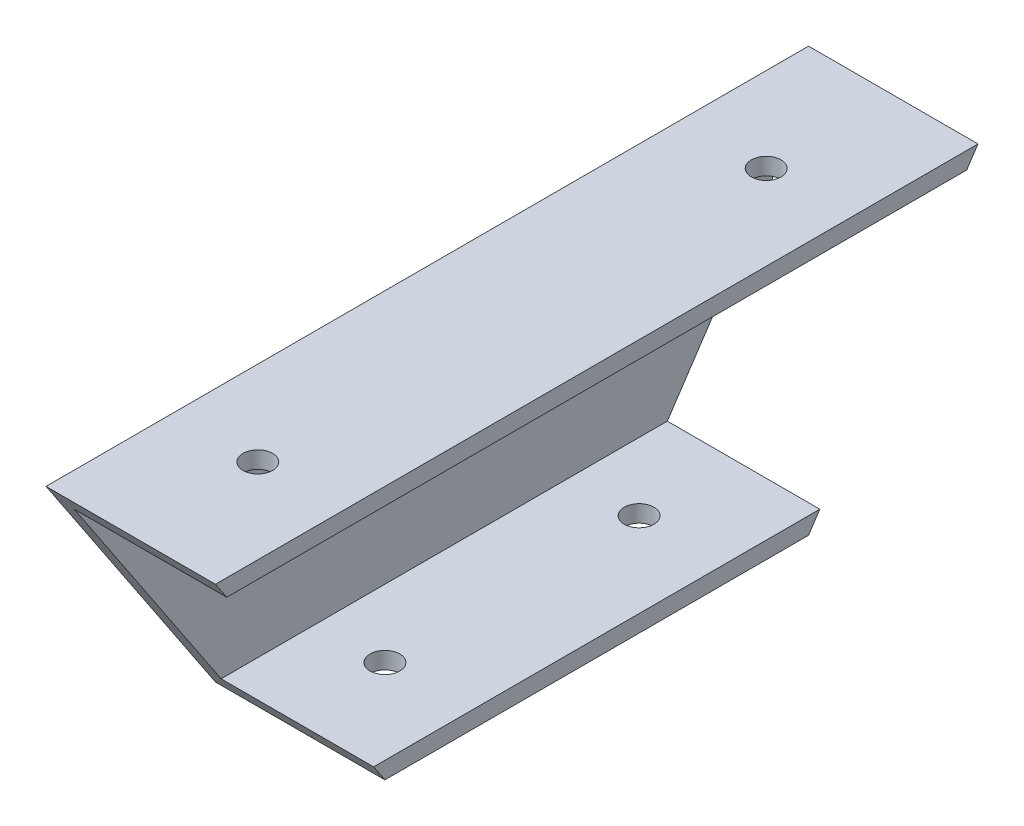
ISO-10303-21;
HEADER;
FILE_DESCRIPTION(('STEP AP214'),'2;1');
FILE_NAME('part.step','',(''),(''),'','','');
FILE_SCHEMA(('AUTOMOTIVE_DESIGN { 1 0 10303 214 1 1 1 1 }'));
ENDSEC;
DATA;
#1=APPLICATION_CONTEXT('core data for automotive mechanical design processes');
#2=APPLICATION_PROTOCOL_DEFINITION('international standard','automotive_design',2000,#1);
#3=PRODUCT_CONTEXT('',#1,'mechanical');
#4=PRODUCT('Part','Part','',(#3));
#5=PRODUCT_RELATED_PRODUCT_CATEGORY('part','',(#4));
#6=PRODUCT_DEFINITION_FORMATION('','',#4);
#7=PRODUCT_DEFINITION_CONTEXT('part definition',#1,'design');
#8=PRODUCT_DEFINITION('design','',#6,#7);
#9=PRODUCT_DEFINITION_SHAPE('','',#8);
#10=(LENGTH_UNIT() NAMED_UNIT(*) SI_UNIT(.MILLI.,.METRE.));
#11=(NAMED_UNIT(*) PLANE_ANGLE_UNIT() SI_UNIT($,.RADIAN.));
#12=(NAMED_UNIT(*) SI_UNIT($,.STERADIAN.) SOLID_ANGLE_UNIT());
#13=UNCERTAINTY_MEASURE_WITH_UNIT(LENGTH_MEASURE(1.E-05),#10,'distance_accuracy_value','');
#14=(GEOMETRIC_REPRESENTATION_CONTEXT(3) GLOBAL_UNCERTAINTY_ASSIGNED_CONTEXT((#13)) GLOBAL_UNIT_ASSIGNED_CONTEXT((#10,
#11,#12)) REPRESENTATION_CONTEXT('',''));
#15=CARTESIAN_POINT('',(0.,0.,0.));
#16=DIRECTION('',(0.,0.,1.));
#17=DIRECTION('',(1.,0.,0.));
#18=AXIS2_PLACEMENT_3D('',#15,#16,#17);
#19=CARTESIAN_POINT('',(0.,30.,90.));
#20=DIRECTION('',(1.,0.,0.));
#21=DIRECTION('',(0.,1.,0.));
#22=AXIS2_PLACEMENT_3D('',#19,#20,#21);
#23=PLANE('',#22);
#24=DIRECTION('',(0.,0.,-1.));
#25=VECTOR('',#24,1.);
#26=CARTESIAN_POINT('',(0.,0.,90.));
#27=LINE('',#26,#25);
#28=CARTESIAN_POINT('',(0.,0.,70.));
#29=VERTEX_POINT('',#28);
#30=CARTESIAN_POINT('',(0.,0.,20.));
#31=VERTEX_POINT('',#30);
#32=EDGE_CURVE('E11',#29,#31,#27,.T.);
#33=ORIENTED_EDGE('',*,*,#32,.F.);
#34=DIRECTION('',(0.,0.832050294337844,0.554700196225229));
#35=VECTOR('',#34,1.);
#36=CARTESIAN_POINT('',(0.,30.,90.));
#37=LINE('',#36,#35);
#38=CARTESIAN_POINT('',(0.,30.,90.));
#39=VERTEX_POINT('',#38);
#40=EDGE_CURVE('E90',#29,#39,#37,.T.);
#41=ORIENTED_EDGE('',*,*,#40,.T.);
#42=DIRECTION('',(0.,0.,-1.));
#43=VECTOR('',#42,1.);
#44=CARTESIAN_POINT('',(0.,30.,90.));
#45=LINE('',#44,#43);
#46=CARTESIAN_POINT('',(0.,30.,0.));
#47=VERTEX_POINT('',#46);
#48=EDGE_CURVE('E113',#39,#47,#45,.T.);
#49=ORIENTED_EDGE('',*,*,#48,.T.);
#50=DIRECTION('',(0.,-0.832050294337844,0.554700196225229));
#51=VECTOR('',#50,1.);
#52=CARTESIAN_POINT('',(0.,-11.5384615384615,27.6923076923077));
#53=LINE('',#52,#51);
#54=EDGE_CURVE('E112',#47,#31,#53,.T.);
#55=ORIENTED_EDGE('',*,*,#54,.T.);
#56=EDGE_LOOP('',(#33,#41,#49,#55));
#57=FACE_BOUND('',#56,.T.);
#58=ADVANCED_FACE('F31',(#57),#23,.F.);
#59=CARTESIAN_POINT('',(0.,0.,90.));
#60=DIRECTION('',(0.,1.,0.));
#61=DIRECTION('',(0.,0.,1.));
#62=AXIS2_PLACEMENT_3D('',#59,#60,#61);
#63=PLANE('',#62);
#64=CARTESIAN_POINT('',(9.99999999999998,0.,60.));
#65=DIRECTION('',(0.,-1.,0.));
#66=DIRECTION('',(0.,0.,-1.));
#67=AXIS2_PLACEMENT_3D('',#64,#65,#66);
#68=CIRCLE('',#67,1.75);
#69=CARTESIAN_POINT('',(9.99999999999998,0.,58.25));
#70=VERTEX_POINT('',#69);
#71=EDGE_CURVE('E144',#70,#70,#68,.T.);
#72=ORIENTED_EDGE('',*,*,#71,.F.);
#73=EDGE_LOOP('',(#72));
#74=FACE_BOUND('',#73,.T.);
#75=CARTESIAN_POINT('',(9.99999999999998,0.,30.));
#76=DIRECTION('',(0.,-1.,0.));
#77=DIRECTION('',(0.,0.,-1.));
#78=AXIS2_PLACEMENT_3D('',#75,#76,#77);
#79=CIRCLE('',#78,1.75);
#80=CARTESIAN_POINT('',(9.99999999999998,0.,28.25));
#81=VERTEX_POINT('',#80);
#82=EDGE_CURVE('E141',#81,#81,#79,.T.);
#83=ORIENTED_EDGE('',*,*,#82,.F.);
#84=EDGE_LOOP('',(#83));
#85=FACE_BOUND('',#84,.T.);
#86=DIRECTION('',(0.,0.,-1.));
#87=VECTOR('',#86,1.);
#88=CARTESIAN_POINT('',(20.,0.,90.));
#89=LINE('',#88,#87);
#90=CARTESIAN_POINT('',(20.,0.,70.));
#91=VERTEX_POINT('',#90);
#92=CARTESIAN_POINT('',(20.,0.,20.));
#93=VERTEX_POINT('',#92);
#94=EDGE_CURVE('E40',#91,#93,#89,.T.);
#95=ORIENTED_EDGE('',*,*,#94,.F.);
#96=DIRECTION('',(1.,0.,0.));
#97=VECTOR('',#96,1.);
#98=CARTESIAN_POINT('',(-43.,0.,70.));
#99=LINE('',#98,#97);
#100=EDGE_CURVE('E93',#29,#91,#99,.T.);
#101=ORIENTED_EDGE('',*,*,#100,.F.);
#102=ORIENTED_EDGE('',*,*,#32,.T.);
#103=DIRECTION('',(1.,0.,0.));
#104=VECTOR('',#103,1.);
#105=CARTESIAN_POINT('',(-43.,0.,20.));
#106=LINE('',#105,#104);
#107=EDGE_CURVE('E101',#31,#93,#106,.T.);
#108=ORIENTED_EDGE('',*,*,#107,.T.);
#109=EDGE_LOOP('',(#95,#101,#102,#108));
#110=FACE_BOUND('',#109,.T.);
#111=ADVANCED_FACE('F106',(#74,#85,#110),#63,.F.);
#112=CARTESIAN_POINT('',(20.,0.,90.));
#113=DIRECTION('',(-1.,0.,0.));
#114=DIRECTION('',(0.,0.,1.));
#115=AXIS2_PLACEMENT_3D('',#112,#113,#114);
#116=PLANE('',#115);
#117=DIRECTION('',(0.,0.,-1.));
#118=VECTOR('',#117,1.);
#119=CARTESIAN_POINT('',(20.,2.,90.));
#120=LINE('',#119,#118);
#121=CARTESIAN_POINT('',(20.,2.,71.3333333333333));
#122=VERTEX_POINT('',#121);
#123=CARTESIAN_POINT('',(20.,2.,18.6666666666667));
#124=VERTEX_POINT('',#123);
#125=EDGE_CURVE('E136',#122,#124,#120,.T.);
#126=ORIENTED_EDGE('',*,*,#125,.F.);
#127=DIRECTION('',(0.,-0.832050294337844,-0.554700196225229));
#128=VECTOR('',#127,1.);
#129=CARTESIAN_POINT('',(20.,9.23076923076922,76.1538461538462));
#130=LINE('',#129,#128);
#131=EDGE_CURVE('E102',#122,#91,#130,.T.);
#132=ORIENTED_EDGE('',*,*,#131,.T.);
#133=ORIENTED_EDGE('',*,*,#94,.T.);
#134=DIRECTION('',(0.,0.832050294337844,-0.554700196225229));
#135=VECTOR('',#134,1.);
#136=CARTESIAN_POINT('',(20.,-32.3076923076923,41.5384615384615));
#137=LINE('',#136,#135);
#138=EDGE_CURVE('E117',#93,#124,#137,.T.);
#139=ORIENTED_EDGE('',*,*,#138,.T.);
#140=EDGE_LOOP('',(#126,#132,#133,#139));
#141=FACE_BOUND('',#140,.T.);
#142=ADVANCED_FACE('F193',(#141),#116,.F.);
#143=CARTESIAN_POINT('',(20.,2.,90.));
#144=DIRECTION('',(0.,-1.,0.));
#145=DIRECTION('',(1.,0.,0.));
#146=AXIS2_PLACEMENT_3D('',#143,#144,#145);
#147=PLANE('',#146);
#148=CARTESIAN_POINT('',(9.99999999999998,2.,60.));
#149=DIRECTION('',(0.,-1.,0.));
#150=DIRECTION('',(1.,0.,0.));
#151=AXIS2_PLACEMENT_3D('',#148,#149,#150);
#152=CIRCLE('',#151,1.75);
#153=CARTESIAN_POINT('',(11.75,2.,60.));
#154=VERTEX_POINT('',#153);
#155=EDGE_CURVE('E142',#154,#154,#152,.T.);
#156=ORIENTED_EDGE('',*,*,#155,.T.);
#157=EDGE_LOOP('',(#156));
#158=FACE_BOUND('',#157,.T.);
#159=CARTESIAN_POINT('',(9.99999999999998,2.,30.));
#160=DIRECTION('',(0.,-1.,0.));
#161=DIRECTION('',(1.,0.,0.));
#162=AXIS2_PLACEMENT_3D('',#159,#160,#161);
#163=CIRCLE('',#162,1.75);
#164=CARTESIAN_POINT('',(11.75,2.,30.));
#165=VERTEX_POINT('',#164);
#166=EDGE_CURVE('E109',#165,#165,#163,.T.);
#167=ORIENTED_EDGE('',*,*,#166,.T.);
#168=EDGE_LOOP('',(#167));
#169=FACE_BOUND('',#168,.T.);
#170=DIRECTION('',(0.,0.,-1.));
#171=VECTOR('',#170,1.);
#172=CARTESIAN_POINT('',(2.00000000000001,2.,90.));
#173=LINE('',#172,#171);
#174=CARTESIAN_POINT('',(2.00000000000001,2.,71.3333333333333));
#175=VERTEX_POINT('',#174);
#176=CARTESIAN_POINT('',(2.00000000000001,1.99999999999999,18.6666666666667));
#177=VERTEX_POINT('',#176);
#178=EDGE_CURVE('E134',#175,#177,#173,.T.);
#179=ORIENTED_EDGE('',*,*,#178,.F.);
#180=DIRECTION('',(1.,0.,0.));
#181=VECTOR('',#180,1.);
#182=CARTESIAN_POINT('',(20.,2.,71.3333333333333));
#183=LINE('',#182,#181);
#184=EDGE_CURVE('E169',#175,#122,#183,.T.);
#185=ORIENTED_EDGE('',*,*,#184,.T.);
#186=ORIENTED_EDGE('',*,*,#125,.T.);
#187=DIRECTION('',(-1.,0.,0.));
#188=VECTOR('',#187,1.);
#189=CARTESIAN_POINT('',(20.,2.,18.6666666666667));
#190=LINE('',#189,#188);
#191=EDGE_CURVE('E121',#124,#177,#190,.T.);
#192=ORIENTED_EDGE('',*,*,#191,.T.);
#193=EDGE_LOOP('',(#179,#185,#186,#192));
#194=FACE_BOUND('',#193,.T.);
#195=ADVANCED_FACE('F186',(#158,#169,#194),#147,.F.);
#196=CARTESIAN_POINT('',(2.00000000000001,2.,90.));
#197=DIRECTION('',(-1.,0.,0.));
#198=DIRECTION('',(0.,-1.,0.));
#199=AXIS2_PLACEMENT_3D('',#196,#197,#198);
#200=PLANE('',#199);
#201=DIRECTION('',(0.,0.,-1.));
#202=VECTOR('',#201,1.);
#203=CARTESIAN_POINT('',(2.00000000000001,28.,90.));
#204=LINE('',#203,#202);
#205=CARTESIAN_POINT('',(2.00000000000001,28.,88.6666666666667));
#206=VERTEX_POINT('',#205);
#207=CARTESIAN_POINT('',(2.00000000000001,28.,1.33333333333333));
#208=VERTEX_POINT('',#207);
#209=EDGE_CURVE('E132',#206,#208,#204,.T.);
#210=ORIENTED_EDGE('',*,*,#209,.F.);
#211=DIRECTION('',(0.,-0.832050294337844,-0.554700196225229));
#212=VECTOR('',#211,1.);
#213=CARTESIAN_POINT('',(2.00000000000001,10.6153846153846,77.0769230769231));
#214=LINE('',#213,#212);
#215=EDGE_CURVE('E166',#206,#175,#214,.T.);
#216=ORIENTED_EDGE('',*,*,#215,.T.);
#217=ORIENTED_EDGE('',*,*,#178,.T.);
#218=DIRECTION('',(0.,0.832050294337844,-0.554700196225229));
#219=VECTOR('',#218,1.);
#220=CARTESIAN_POINT('',(2.00000000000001,-30.9230769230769,40.6153846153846));
#221=LINE('',#220,#219);
#222=EDGE_CURVE('E180',#177,#208,#221,.T.);
#223=ORIENTED_EDGE('',*,*,#222,.T.);
#224=EDGE_LOOP('',(#210,#216,#217,#223));
#225=FACE_BOUND('',#224,.T.);
#226=ADVANCED_FACE('F196',(#225),#200,.F.);
#227=CARTESIAN_POINT('',(2.00000000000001,28.,90.));
#228=DIRECTION('',(0.,1.,0.));
#229=DIRECTION('',(-1.,0.,0.));
#230=AXIS2_PLACEMENT_3D('',#227,#228,#229);
#231=PLANE('',#230);
#232=CARTESIAN_POINT('',(10.,28.,75.));
#233=DIRECTION('',(0.,-1.,0.));
#234=DIRECTION('',(1.,0.,0.));
#235=AXIS2_PLACEMENT_3D('',#232,#233,#234);
#236=CIRCLE('',#235,1.75);
#237=CARTESIAN_POINT('',(11.75,28.,75.));
#238=VERTEX_POINT('',#237);
#239=EDGE_CURVE('E157',#238,#238,#236,.T.);
#240=ORIENTED_EDGE('',*,*,#239,.F.);
#241=EDGE_LOOP('',(#240));
#242=FACE_BOUND('',#241,.T.);
#243=CARTESIAN_POINT('',(10.,28.,15.));
#244=DIRECTION('',(0.,-1.,0.));
#245=DIRECTION('',(1.,0.,0.));
#246=AXIS2_PLACEMENT_3D('',#243,#244,#245);
#247=CIRCLE('',#246,1.75);
#248=CARTESIAN_POINT('',(11.75,28.,15.));
#249=VERTEX_POINT('',#248);
#250=EDGE_CURVE('E147',#249,#249,#247,.T.);
#251=ORIENTED_EDGE('',*,*,#250,.F.);
#252=EDGE_LOOP('',(#251));
#253=FACE_BOUND('',#252,.T.);
#254=DIRECTION('',(0.,0.,-1.));
#255=VECTOR('',#254,1.);
#256=CARTESIAN_POINT('',(20.,28.,90.));
#257=LINE('',#256,#255);
#258=CARTESIAN_POINT('',(20.,28.,88.6666666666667));
#259=VERTEX_POINT('',#258);
#260=CARTESIAN_POINT('',(20.,28.,1.33333333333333));
#261=VERTEX_POINT('',#260);
#262=EDGE_CURVE('E130',#259,#261,#257,.T.);
#263=ORIENTED_EDGE('',*,*,#262,.F.);
#264=DIRECTION('',(-1.,0.,0.));
#265=VECTOR('',#264,1.);
#266=CARTESIAN_POINT('',(2.00000000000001,28.,88.6666666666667));
#267=LINE('',#266,#265);
#268=EDGE_CURVE('E163',#259,#206,#267,.T.);
#269=ORIENTED_EDGE('',*,*,#268,.T.);
#270=ORIENTED_EDGE('',*,*,#209,.T.);
#271=DIRECTION('',(1.,0.,0.));
#272=VECTOR('',#271,1.);
#273=CARTESIAN_POINT('',(2.00000000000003,28.,1.33333333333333));
#274=LINE('',#273,#272);
#275=EDGE_CURVE('E177',#208,#261,#274,.T.);
#276=ORIENTED_EDGE('',*,*,#275,.T.);
#277=EDGE_LOOP('',(#263,#269,#270,#276));
#278=FACE_BOUND('',#277,.T.);
#279=ADVANCED_FACE('F199',(#242,#253,#278),#231,.F.);
#280=CARTESIAN_POINT('',(20.,28.,90.));
#281=DIRECTION('',(-1.,0.,0.));
#282=DIRECTION('',(0.,-1.,0.));
#283=AXIS2_PLACEMENT_3D('',#280,#281,#282);
#284=PLANE('',#283);
#285=DIRECTION('',(0.,0.,-1.));
#286=VECTOR('',#285,1.);
#287=CARTESIAN_POINT('',(20.,30.,90.));
#288=LINE('',#287,#286);
#289=CARTESIAN_POINT('',(20.,30.,90.));
#290=VERTEX_POINT('',#289);
#291=CARTESIAN_POINT('',(20.,30.,0.));
#292=VERTEX_POINT('',#291);
#293=EDGE_CURVE('E127',#290,#292,#288,.T.);
#294=ORIENTED_EDGE('',*,*,#293,.F.);
#295=DIRECTION('',(0.,-0.832050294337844,-0.554700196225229));
#296=VECTOR('',#295,1.);
#297=CARTESIAN_POINT('',(20.,28.6153846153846,89.0769230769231));
#298=LINE('',#297,#296);
#299=EDGE_CURVE('E47',#290,#259,#298,.T.);
#300=ORIENTED_EDGE('',*,*,#299,.T.);
#301=ORIENTED_EDGE('',*,*,#262,.T.);
#302=DIRECTION('',(0.,0.832050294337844,-0.554700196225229));
#303=VECTOR('',#302,1.);
#304=CARTESIAN_POINT('',(20.0000000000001,-12.9230769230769,28.6153846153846));
#305=LINE('',#304,#303);
#306=EDGE_CURVE('E174',#261,#292,#305,.T.);
#307=ORIENTED_EDGE('',*,*,#306,.T.);
#308=EDGE_LOOP('',(#294,#300,#301,#307));
#309=FACE_BOUND('',#308,.T.);
#310=ADVANCED_FACE('F202',(#309),#284,.F.);
#311=CARTESIAN_POINT('',(20.,30.,90.));
#312=DIRECTION('',(0.,-1.,0.));
#313=DIRECTION('',(1.,0.,0.));
#314=AXIS2_PLACEMENT_3D('',#311,#312,#313);
#315=PLANE('',#314);
#316=CARTESIAN_POINT('',(10.,30.,75.));
#317=DIRECTION('',(0.,-1.,0.));
#318=DIRECTION('',(1.,0.,0.));
#319=AXIS2_PLACEMENT_3D('',#316,#317,#318);
#320=CIRCLE('',#319,1.75);
#321=CARTESIAN_POINT('',(11.75,30.,75.));
#322=VERTEX_POINT('',#321);
#323=EDGE_CURVE('E34',#322,#322,#320,.T.);
#324=ORIENTED_EDGE('',*,*,#323,.T.);
#325=EDGE_LOOP('',(#324));
#326=FACE_BOUND('',#325,.T.);
#327=CARTESIAN_POINT('',(10.,30.,15.));
#328=DIRECTION('',(0.,-1.,0.));
#329=DIRECTION('',(1.,0.,0.));
#330=AXIS2_PLACEMENT_3D('',#327,#328,#329);
#331=CIRCLE('',#330,1.75);
#332=CARTESIAN_POINT('',(11.75,30.,15.));
#333=VERTEX_POINT('',#332);
#334=EDGE_CURVE('E145',#333,#333,#331,.T.);
#335=ORIENTED_EDGE('',*,*,#334,.T.);
#336=EDGE_LOOP('',(#335));
#337=FACE_BOUND('',#336,.T.);
#338=DIRECTION('',(-1.,0.,0.));
#339=VECTOR('',#338,1.);
#340=CARTESIAN_POINT('',(20.,30.,0.));
#341=LINE('',#340,#339);
#342=EDGE_CURVE('E116',#292,#47,#341,.T.);
#343=ORIENTED_EDGE('',*,*,#342,.T.);
#344=ORIENTED_EDGE('',*,*,#48,.F.);
#345=DIRECTION('',(-1.,0.,0.));
#346=VECTOR('',#345,1.);
#347=CARTESIAN_POINT('',(20.,30.,90.));
#348=LINE('',#347,#346);
#349=EDGE_CURVE('E96',#290,#39,#348,.T.);
#350=ORIENTED_EDGE('',*,*,#349,.F.);
#351=ORIENTED_EDGE('',*,*,#293,.T.);
#352=EDGE_LOOP('',(#343,#344,#350,#351));
#353=FACE_BOUND('',#352,.T.);
#354=ADVANCED_FACE('F204',(#326,#337,#353),#315,.F.);
#355=CARTESIAN_POINT('',(-43.,0.,20.));
#356=DIRECTION('',(0.,0.554700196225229,0.832050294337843));
#357=DIRECTION('',(0.,-0.832050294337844,0.554700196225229));
#358=AXIS2_PLACEMENT_3D('',#355,#356,#357);
#359=PLANE('',#358);
#360=ORIENTED_EDGE('',*,*,#342,.F.);
#361=ORIENTED_EDGE('',*,*,#306,.F.);
#362=ORIENTED_EDGE('',*,*,#275,.F.);
#363=ORIENTED_EDGE('',*,*,#222,.F.);
#364=ORIENTED_EDGE('',*,*,#191,.F.);
#365=ORIENTED_EDGE('',*,*,#138,.F.);
#366=ORIENTED_EDGE('',*,*,#107,.F.);
#367=ORIENTED_EDGE('',*,*,#54,.F.);
#368=EDGE_LOOP('',(#360,#361,#362,#363,#364,#365,#366,#367));
#369=FACE_BOUND('',#368,.T.);
#370=ADVANCED_FACE('F190',(#369),#359,.F.);
#371=CARTESIAN_POINT('',(-43.,0.,70.));
#372=DIRECTION('',(0.,0.554700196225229,-0.832050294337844));
#373=DIRECTION('',(0.,0.832050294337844,0.554700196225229));
#374=AXIS2_PLACEMENT_3D('',#371,#372,#373);
#375=PLANE('',#374);
#376=ORIENTED_EDGE('',*,*,#100,.T.);
#377=ORIENTED_EDGE('',*,*,#131,.F.);
#378=ORIENTED_EDGE('',*,*,#184,.F.);
#379=ORIENTED_EDGE('',*,*,#215,.F.);
#380=ORIENTED_EDGE('',*,*,#268,.F.);
#381=ORIENTED_EDGE('',*,*,#299,.F.);
#382=ORIENTED_EDGE('',*,*,#349,.T.);
#383=ORIENTED_EDGE('',*,*,#40,.F.);
#384=EDGE_LOOP('',(#376,#377,#378,#379,#380,#381,#382,#383));
#385=FACE_BOUND('',#384,.T.);
#386=ADVANCED_FACE('F92',(#385),#375,.F.);
#387=CARTESIAN_POINT('',(9.99999999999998,10.,30.));
#388=DIRECTION('',(0.,-1.,0.));
#389=DIRECTION('',(0.,0.,-1.));
#390=AXIS2_PLACEMENT_3D('',#387,#388,#389);
#391=CYLINDRICAL_SURFACE('',#390,1.75);
#392=ORIENTED_EDGE('',*,*,#82,.T.);
#393=EDGE_LOOP('',(#392));
#394=FACE_BOUND('',#393,.T.);
#395=ORIENTED_EDGE('',*,*,#166,.F.);
#396=EDGE_LOOP('',(#395));
#397=FACE_BOUND('',#396,.T.);
#398=ADVANCED_FACE('F256',(#394,#397),#391,.F.);
#399=CARTESIAN_POINT('',(9.99999999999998,10.,60.));
#400=DIRECTION('',(0.,-1.,0.));
#401=DIRECTION('',(0.,0.,-1.));
#402=AXIS2_PLACEMENT_3D('',#399,#400,#401);
#403=CYLINDRICAL_SURFACE('',#402,1.75);
#404=ORIENTED_EDGE('',*,*,#71,.T.);
#405=EDGE_LOOP('',(#404));
#406=FACE_BOUND('',#405,.T.);
#407=ORIENTED_EDGE('',*,*,#155,.F.);
#408=EDGE_LOOP('',(#407));
#409=FACE_BOUND('',#408,.T.);
#410=ADVANCED_FACE('F251',(#406,#409),#403,.F.);
#411=CARTESIAN_POINT('',(10.,38.,15.));
#412=DIRECTION('',(0.,-1.,0.));
#413=DIRECTION('',(1.,0.,0.));
#414=AXIS2_PLACEMENT_3D('',#411,#412,#413);
#415=CYLINDRICAL_SURFACE('',#414,1.75);
#416=ORIENTED_EDGE('',*,*,#250,.T.);
#417=EDGE_LOOP('',(#416));
#418=FACE_BOUND('',#417,.T.);
#419=ORIENTED_EDGE('',*,*,#334,.F.);
#420=EDGE_LOOP('',(#419));
#421=FACE_BOUND('',#420,.T.);
#422=ADVANCED_FACE('F245',(#418,#421),#415,.F.);
#423=CARTESIAN_POINT('',(10.,38.,75.));
#424=DIRECTION('',(0.,-1.,0.));
#425=DIRECTION('',(1.,0.,0.));
#426=AXIS2_PLACEMENT_3D('',#423,#424,#425);
#427=CYLINDRICAL_SURFACE('',#426,1.75);
#428=ORIENTED_EDGE('',*,*,#239,.T.);
#429=EDGE_LOOP('',(#428));
#430=FACE_BOUND('',#429,.T.);
#431=ORIENTED_EDGE('',*,*,#323,.F.);
#432=EDGE_LOOP('',(#431));
#433=FACE_BOUND('',#432,.T.);
#434=ADVANCED_FACE('F242',(#430,#433),#427,.F.);
#435=CLOSED_SHELL('',(#58,#111,#142,#195,#226,#279,#310,#354,#370,#386,#398,#410,#422,#434));
#436=MANIFOLD_SOLID_BREP('B2',#435);
#437=ADVANCED_BREP_SHAPE_REPRESENTATION('',(#18,#436),#14);
#438=SHAPE_DEFINITION_REPRESENTATION(#9,#437);
ENDSEC;
END-ISO-10303-21;
